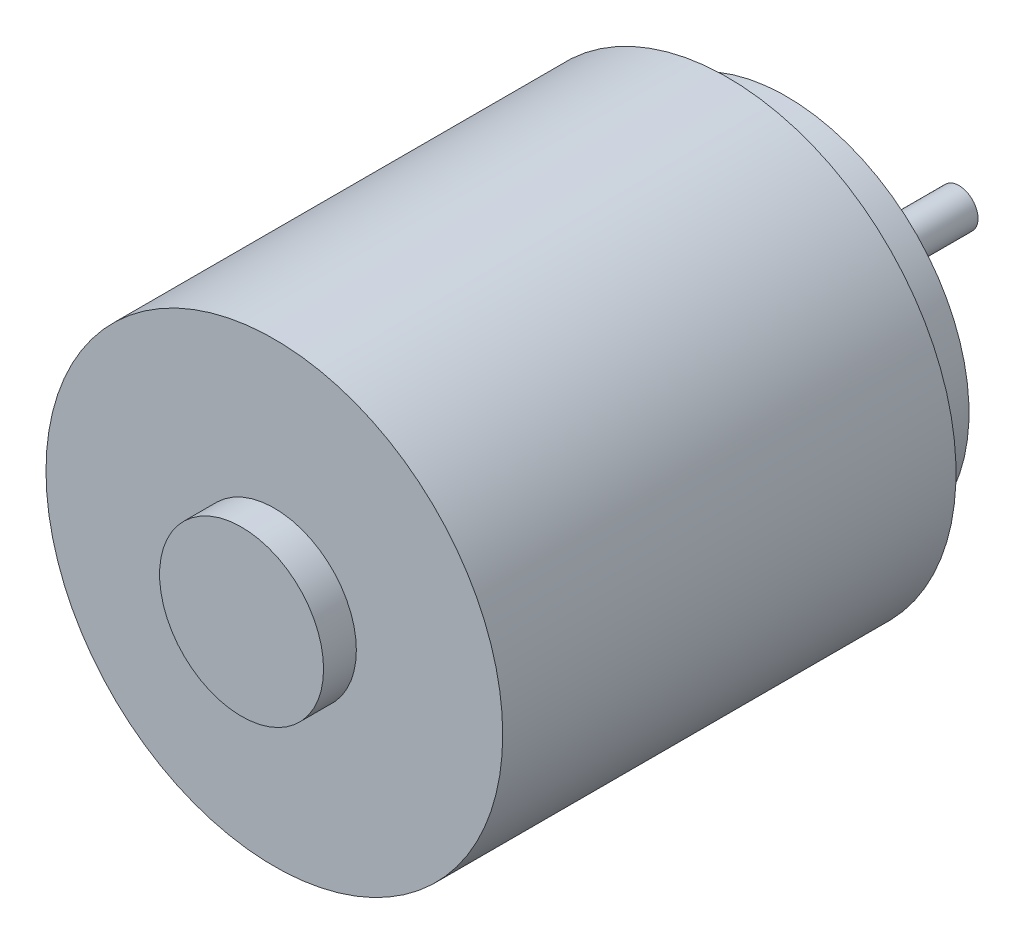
ISO-10303-21;
HEADER;
FILE_DESCRIPTION(('STEP AP214'),'2;1');
FILE_NAME('part.step','',(''),(''),'','','');
FILE_SCHEMA(('AUTOMOTIVE_DESIGN { 1 0 10303 214 1 1 1 1 }'));
ENDSEC;
DATA;
#1=APPLICATION_CONTEXT('core data for automotive mechanical design processes');
#2=APPLICATION_PROTOCOL_DEFINITION('international standard','automotive_design',2000,#1);
#3=PRODUCT_CONTEXT('',#1,'mechanical');
#4=PRODUCT('Part','Part','',(#3));
#5=PRODUCT_RELATED_PRODUCT_CATEGORY('part','',(#4));
#6=PRODUCT_DEFINITION_FORMATION('','',#4);
#7=PRODUCT_DEFINITION_CONTEXT('part definition',#1,'design');
#8=PRODUCT_DEFINITION('design','',#6,#7);
#9=PRODUCT_DEFINITION_SHAPE('','',#8);
#10=(LENGTH_UNIT() NAMED_UNIT(*) SI_UNIT(.MILLI.,.METRE.));
#11=(NAMED_UNIT(*) PLANE_ANGLE_UNIT() SI_UNIT($,.RADIAN.));
#12=(NAMED_UNIT(*) SI_UNIT($,.STERADIAN.) SOLID_ANGLE_UNIT());
#13=UNCERTAINTY_MEASURE_WITH_UNIT(LENGTH_MEASURE(1.E-05),#10,'distance_accuracy_value','');
#14=(GEOMETRIC_REPRESENTATION_CONTEXT(3) GLOBAL_UNCERTAINTY_ASSIGNED_CONTEXT((#13)) GLOBAL_UNIT_ASSIGNED_CONTEXT((#10,
#11,#12)) REPRESENTATION_CONTEXT('',''));
#15=CARTESIAN_POINT('',(0.,0.,0.));
#16=DIRECTION('',(0.,0.,1.));
#17=DIRECTION('',(1.,0.,0.));
#18=AXIS2_PLACEMENT_3D('',#15,#16,#17);
#19=CARTESIAN_POINT('',(0.,0.,-1.7));
#20=DIRECTION('',(0.,0.,-1.));
#21=DIRECTION('',(-1.,0.,0.));
#22=AXIS2_PLACEMENT_3D('',#19,#20,#21);
#23=PLANE('',#22);
#24=CARTESIAN_POINT('',(0.,0.,-1.7));
#25=DIRECTION('',(0.,0.,-1.));
#26=DIRECTION('',(-1.,0.,0.));
#27=AXIS2_PLACEMENT_3D('',#24,#25,#26);
#28=CIRCLE('',#27,3.0099);
#29=CARTESIAN_POINT('',(-3.0099,0.,-1.7));
#30=VERTEX_POINT('',#29);
#31=EDGE_CURVE('E58',#30,#30,#28,.T.);
#32=ORIENTED_EDGE('',*,*,#31,.T.);
#33=EDGE_LOOP('',(#32));
#34=FACE_BOUND('',#33,.T.);
#35=CARTESIAN_POINT('',(0.,0.,-1.7));
#36=DIRECTION('',(0.,0.,-1.));
#37=DIRECTION('',(-1.,0.,0.));
#38=AXIS2_PLACEMENT_3D('',#35,#36,#37);
#39=CIRCLE('',#38,0.9906);
#40=CARTESIAN_POINT('',(-0.9906,0.,-1.7));
#41=VERTEX_POINT('',#40);
#42=EDGE_CURVE('E66',#41,#41,#39,.T.);
#43=ORIENTED_EDGE('',*,*,#42,.F.);
#44=EDGE_LOOP('',(#43));
#45=FACE_BOUND('',#44,.T.);
#46=ADVANCED_FACE('F27',(#34,#45),#23,.T.);
#47=CARTESIAN_POINT('',(0.,0.,0.));
#48=DIRECTION('',(0.,0.,1.));
#49=DIRECTION('',(1.,0.,0.));
#50=AXIS2_PLACEMENT_3D('',#47,#48,#49);
#51=PLANE('',#50);
#52=CARTESIAN_POINT('',(0.,0.,0.));
#53=DIRECTION('',(0.,0.,-1.));
#54=DIRECTION('',(-1.,0.,0.));
#55=AXIS2_PLACEMENT_3D('',#52,#53,#54);
#56=CIRCLE('',#55,9.4615);
#57=CARTESIAN_POINT('',(-9.4615,0.,0.));
#58=VERTEX_POINT('',#57);
#59=EDGE_CURVE('E53',#58,#58,#56,.T.);
#60=ORIENTED_EDGE('',*,*,#59,.T.);
#61=EDGE_LOOP('',(#60));
#62=FACE_BOUND('',#61,.T.);
#63=CARTESIAN_POINT('',(0.,0.,0.));
#64=DIRECTION('',(0.,0.,1.));
#65=DIRECTION('',(1.,0.,0.));
#66=AXIS2_PLACEMENT_3D('',#63,#64,#65);
#67=CIRCLE('',#66,3.0099);
#68=CARTESIAN_POINT('',(3.0099,0.,0.));
#69=VERTEX_POINT('',#68);
#70=EDGE_CURVE('E10',#69,#69,#67,.F.);
#71=ORIENTED_EDGE('',*,*,#70,.F.);
#72=EDGE_LOOP('',(#71));
#73=FACE_BOUND('',#72,.T.);
#74=ADVANCED_FACE('F73',(#62,#73),#51,.F.);
#75=CARTESIAN_POINT('',(0.,0.,26.543));
#76=DIRECTION('',(0.,0.,-1.));
#77=DIRECTION('',(-1.,0.,0.));
#78=AXIS2_PLACEMENT_3D('',#75,#76,#77);
#79=CYLINDRICAL_SURFACE('',#78,11.8364);
#80=CARTESIAN_POINT('',(0.,0.,26.543));
#81=DIRECTION('',(0.,0.,1.));
#82=DIRECTION('',(1.,0.,0.));
#83=AXIS2_PLACEMENT_3D('',#80,#81,#82);
#84=CIRCLE('',#83,11.8364);
#85=CARTESIAN_POINT('',(11.8364,0.,26.543));
#86=VERTEX_POINT('',#85);
#87=EDGE_CURVE('E34',#86,#86,#84,.T.);
#88=ORIENTED_EDGE('',*,*,#87,.F.);
#89=EDGE_LOOP('',(#88));
#90=FACE_BOUND('',#89,.T.);
#91=CARTESIAN_POINT('',(0.,0.,3.048));
#92=DIRECTION('',(0.,0.,-1.));
#93=DIRECTION('',(-1.,0.,0.));
#94=AXIS2_PLACEMENT_3D('',#91,#92,#93);
#95=CIRCLE('',#94,11.8364);
#96=CARTESIAN_POINT('',(-11.8364,0.,3.048));
#97=VERTEX_POINT('',#96);
#98=EDGE_CURVE('E46',#97,#97,#95,.T.);
#99=ORIENTED_EDGE('',*,*,#98,.F.);
#100=EDGE_LOOP('',(#99));
#101=FACE_BOUND('',#100,.T.);
#102=ADVANCED_FACE('F29',(#90,#101),#79,.T.);
#103=CARTESIAN_POINT('',(0.,0.,26.543));
#104=DIRECTION('',(0.,0.,1.));
#105=DIRECTION('',(1.,0.,0.));
#106=AXIS2_PLACEMENT_3D('',#103,#104,#105);
#107=PLANE('',#106);
#108=ORIENTED_EDGE('',*,*,#87,.T.);
#109=EDGE_LOOP('',(#108));
#110=FACE_BOUND('',#109,.T.);
#111=CARTESIAN_POINT('',(0.,0.,26.543));
#112=DIRECTION('',(0.,0.,1.));
#113=DIRECTION('',(1.,0.,0.));
#114=AXIS2_PLACEMENT_3D('',#111,#112,#113);
#115=CIRCLE('',#114,4.25);
#116=CARTESIAN_POINT('',(4.25,0.,26.543));
#117=VERTEX_POINT('',#116);
#118=EDGE_CURVE('E43',#117,#117,#115,.T.);
#119=ORIENTED_EDGE('',*,*,#118,.F.);
#120=EDGE_LOOP('',(#119));
#121=FACE_BOUND('',#120,.T.);
#122=ADVANCED_FACE('F101',(#110,#121),#107,.T.);
#123=CARTESIAN_POINT('',(0.,0.,28.243));
#124=DIRECTION('',(0.,0.,-1.));
#125=DIRECTION('',(-1.,0.,0.));
#126=AXIS2_PLACEMENT_3D('',#123,#124,#125);
#127=CYLINDRICAL_SURFACE('',#126,4.25);
#128=CARTESIAN_POINT('',(0.,0.,28.243));
#129=DIRECTION('',(0.,0.,1.));
#130=DIRECTION('',(1.,0.,0.));
#131=AXIS2_PLACEMENT_3D('',#128,#129,#130);
#132=CIRCLE('',#131,4.25);
#133=CARTESIAN_POINT('',(4.25,0.,28.243));
#134=VERTEX_POINT('',#133);
#135=EDGE_CURVE('E38',#134,#134,#132,.T.);
#136=ORIENTED_EDGE('',*,*,#135,.F.);
#137=EDGE_LOOP('',(#136));
#138=FACE_BOUND('',#137,.T.);
#139=ORIENTED_EDGE('',*,*,#118,.T.);
#140=EDGE_LOOP('',(#139));
#141=FACE_BOUND('',#140,.T.);
#142=ADVANCED_FACE('F98',(#138,#141),#127,.T.);
#143=CARTESIAN_POINT('',(0.,0.,28.243));
#144=DIRECTION('',(0.,0.,1.));
#145=DIRECTION('',(1.,0.,0.));
#146=AXIS2_PLACEMENT_3D('',#143,#144,#145);
#147=PLANE('',#146);
#148=ORIENTED_EDGE('',*,*,#135,.T.);
#149=EDGE_LOOP('',(#148));
#150=FACE_BOUND('',#149,.T.);
#151=ADVANCED_FACE('F94',(#150),#147,.T.);
#152=CARTESIAN_POINT('',(0.,0.,3.048));
#153=DIRECTION('',(0.,0.,-1.));
#154=DIRECTION('',(-1.,0.,0.));
#155=AXIS2_PLACEMENT_3D('',#152,#153,#154);
#156=PLANE('',#155);
#157=CARTESIAN_POINT('',(0.,0.,3.048));
#158=DIRECTION('',(0.,0.,-1.));
#159=DIRECTION('',(-1.,0.,0.));
#160=AXIS2_PLACEMENT_3D('',#157,#158,#159);
#161=CIRCLE('',#160,9.4615);
#162=CARTESIAN_POINT('',(-9.4615,0.,3.048));
#163=VERTEX_POINT('',#162);
#164=EDGE_CURVE('E48',#163,#163,#161,.T.);
#165=ORIENTED_EDGE('',*,*,#164,.F.);
#166=EDGE_LOOP('',(#165));
#167=FACE_BOUND('',#166,.T.);
#168=ORIENTED_EDGE('',*,*,#98,.T.);
#169=EDGE_LOOP('',(#168));
#170=FACE_BOUND('',#169,.T.);
#171=ADVANCED_FACE('F91',(#167,#170),#156,.T.);
#172=CARTESIAN_POINT('',(0.,0.,3.048));
#173=DIRECTION('',(0.,0.,-1.));
#174=DIRECTION('',(-1.,0.,0.));
#175=AXIS2_PLACEMENT_3D('',#172,#173,#174);
#176=CYLINDRICAL_SURFACE('',#175,9.4615);
#177=CARTESIAN_POINT('',(-9.4615,0.,3.048));
#178=CARTESIAN_POINT('',(-9.4615,0.,3.01625));
#179=CARTESIAN_POINT('',(-9.4615,0.,2.9845));
#180=CARTESIAN_POINT('',(-9.4615,0.,2.921));
#181=CARTESIAN_POINT('',(-9.4615,0.,2.88925));
#182=CARTESIAN_POINT('',(-9.4615,0.,2.82575));
#183=CARTESIAN_POINT('',(-9.4615,0.,2.794));
#184=CARTESIAN_POINT('',(-9.4615,0.,2.7305));
#185=CARTESIAN_POINT('',(-9.4615,0.,2.69875));
#186=CARTESIAN_POINT('',(-9.4615,0.,2.63525));
#187=CARTESIAN_POINT('',(-9.4615,0.,2.6035));
#188=CARTESIAN_POINT('',(-9.4615,0.,2.54));
#189=CARTESIAN_POINT('',(-9.4615,0.,2.50825));
#190=CARTESIAN_POINT('',(-9.4615,0.,2.44475));
#191=CARTESIAN_POINT('',(-9.4615,0.,2.413));
#192=CARTESIAN_POINT('',(-9.4615,0.,2.3495));
#193=CARTESIAN_POINT('',(-9.4615,0.,2.31775));
#194=CARTESIAN_POINT('',(-9.4615,0.,2.25425));
#195=CARTESIAN_POINT('',(-9.4615,0.,2.2225));
#196=CARTESIAN_POINT('',(-9.4615,0.,2.159));
#197=CARTESIAN_POINT('',(-9.4615,0.,2.12725));
#198=CARTESIAN_POINT('',(-9.4615,0.,2.06375));
#199=CARTESIAN_POINT('',(-9.4615,0.,2.032));
#200=CARTESIAN_POINT('',(-9.4615,0.,1.9685));
#201=CARTESIAN_POINT('',(-9.4615,0.,1.93675));
#202=CARTESIAN_POINT('',(-9.4615,0.,1.87325));
#203=CARTESIAN_POINT('',(-9.4615,0.,1.8415));
#204=CARTESIAN_POINT('',(-9.4615,0.,1.778));
#205=CARTESIAN_POINT('',(-9.4615,0.,1.74625));
#206=CARTESIAN_POINT('',(-9.4615,0.,1.68275));
#207=CARTESIAN_POINT('',(-9.4615,0.,1.651));
#208=CARTESIAN_POINT('',(-9.4615,0.,1.5875));
#209=CARTESIAN_POINT('',(-9.4615,0.,1.55575));
#210=CARTESIAN_POINT('',(-9.4615,0.,1.49225));
#211=CARTESIAN_POINT('',(-9.4615,0.,1.4605));
#212=CARTESIAN_POINT('',(-9.4615,0.,1.397));
#213=CARTESIAN_POINT('',(-9.4615,0.,1.36525));
#214=CARTESIAN_POINT('',(-9.4615,0.,1.30175));
#215=CARTESIAN_POINT('',(-9.4615,0.,1.27));
#216=CARTESIAN_POINT('',(-9.4615,0.,1.2065));
#217=CARTESIAN_POINT('',(-9.4615,0.,1.17475));
#218=CARTESIAN_POINT('',(-9.4615,0.,1.11125));
#219=CARTESIAN_POINT('',(-9.4615,0.,1.0795));
#220=CARTESIAN_POINT('',(-9.4615,0.,1.016));
#221=CARTESIAN_POINT('',(-9.4615,0.,0.98425));
#222=CARTESIAN_POINT('',(-9.4615,0.,0.92075));
#223=CARTESIAN_POINT('',(-9.4615,0.,0.889));
#224=CARTESIAN_POINT('',(-9.4615,0.,0.8255));
#225=CARTESIAN_POINT('',(-9.4615,0.,0.79375));
#226=CARTESIAN_POINT('',(-9.4615,0.,0.73025));
#227=CARTESIAN_POINT('',(-9.4615,0.,0.6985));
#228=CARTESIAN_POINT('',(-9.4615,0.,0.635));
#229=CARTESIAN_POINT('',(-9.4615,0.,0.60325));
#230=CARTESIAN_POINT('',(-9.4615,0.,0.53975));
#231=CARTESIAN_POINT('',(-9.4615,0.,0.508));
#232=CARTESIAN_POINT('',(-9.4615,0.,0.4445));
#233=CARTESIAN_POINT('',(-9.4615,0.,0.41275));
#234=CARTESIAN_POINT('',(-9.4615,0.,0.34925));
#235=CARTESIAN_POINT('',(-9.4615,0.,0.3175));
#236=CARTESIAN_POINT('',(-9.4615,0.,0.254));
#237=CARTESIAN_POINT('',(-9.4615,0.,0.22225));
#238=CARTESIAN_POINT('',(-9.4615,0.,0.15875));
#239=CARTESIAN_POINT('',(-9.4615,0.,0.127));
#240=CARTESIAN_POINT('',(-9.4615,0.,0.0634999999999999));
#241=CARTESIAN_POINT('',(-9.4615,0.,0.03175));
#242=CARTESIAN_POINT('',(-9.4615,0.,0.));
#243=B_SPLINE_CURVE_WITH_KNOTS('',3,(#177,#178,#179,#180,#181,#182,#183,#184,#185,#186,#187,
#188,#189,#190,#191,#192,#193,#194,#195,#196,#197,#198,#199,#200,#201,#202,#203,#204,#205,#206,
#207,#208,#209,#210,#211,#212,#213,#214,#215,#216,#217,#218,#219,#220,#221,#222,#223,#224,#225,
#226,#227,#228,#229,#230,#231,#232,#233,#234,#235,#236,#237,#238,#239,#240,#241,#242),
.UNSPECIFIED.,.F.,.F.,(4,2,2,2,2,2,2,2,2,2,2,2,2,2,2,2,2,2,2,2,2,2,2,2,2,2,2,2,2,2,2,2,4),(0.,
0.0952499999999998,0.1905,0.28575,0.381,0.47625,0.5715,0.66675,0.762,0.85725,0.9525,1.04775,
1.143,1.23825,1.3335,1.42875,1.524,1.61925,1.7145,1.80975,1.905,2.00025,2.0955,2.19075,2.286,
2.38125,2.4765,2.57175,2.667,2.76225,2.8575,2.95275,3.048),.UNSPECIFIED.);
#244=EDGE_CURVE('BSEAM87',#163,#58,#243,.T.);
#245=ORIENTED_EDGE('',*,*,#164,.T.);
#246=ORIENTED_EDGE('',*,*,#59,.F.);
#247=ORIENTED_EDGE('',*,*,#244,.T.);
#248=ORIENTED_EDGE('',*,*,#244,.F.);
#249=EDGE_LOOP('',(#245,#247,#246,#248));
#250=FACE_BOUND('',#249,.T.);
#251=ADVANCED_FACE('F87',(#250),#176,.T.);
#252=CARTESIAN_POINT('',(0.,0.,-1.7));
#253=DIRECTION('',(0.,0.,1.));
#254=DIRECTION('',(1.,0.,0.));
#255=AXIS2_PLACEMENT_3D('',#252,#253,#254);
#256=CYLINDRICAL_SURFACE('',#255,3.0099);
#257=ORIENTED_EDGE('',*,*,#31,.F.);
#258=EDGE_LOOP('',(#257));
#259=FACE_BOUND('',#258,.T.);
#260=ORIENTED_EDGE('',*,*,#70,.T.);
#261=EDGE_LOOP('',(#260));
#262=FACE_BOUND('',#261,.T.);
#263=ADVANCED_FACE('F84',(#259,#262),#256,.T.);
#264=CARTESIAN_POINT('',(0.,0.,-8.939));
#265=DIRECTION('',(0.,0.,1.));
#266=DIRECTION('',(1.,0.,0.));
#267=AXIS2_PLACEMENT_3D('',#264,#265,#266);
#268=CYLINDRICAL_SURFACE('',#267,0.9906);
#269=CARTESIAN_POINT('',(0.,0.,-8.939));
#270=DIRECTION('',(0.,0.,-1.));
#271=DIRECTION('',(-1.,0.,0.));
#272=AXIS2_PLACEMENT_3D('',#269,#270,#271);
#273=CIRCLE('',#272,0.9906);
#274=CARTESIAN_POINT('',(-0.9906,0.,-8.939));
#275=VERTEX_POINT('',#274);
#276=EDGE_CURVE('E63',#275,#275,#273,.T.);
#277=ORIENTED_EDGE('',*,*,#276,.F.);
#278=EDGE_LOOP('',(#277));
#279=FACE_BOUND('',#278,.T.);
#280=ORIENTED_EDGE('',*,*,#42,.T.);
#281=EDGE_LOOP('',(#280));
#282=FACE_BOUND('',#281,.T.);
#283=ADVANCED_FACE('F70',(#279,#282),#268,.T.);
#284=CARTESIAN_POINT('',(0.,0.,-8.939));
#285=DIRECTION('',(0.,0.,-1.));
#286=DIRECTION('',(-1.,0.,0.));
#287=AXIS2_PLACEMENT_3D('',#284,#285,#286);
#288=PLANE('',#287);
#289=ORIENTED_EDGE('',*,*,#276,.T.);
#290=EDGE_LOOP('',(#289));
#291=FACE_BOUND('',#290,.T.);
#292=ADVANCED_FACE('F137',(#291),#288,.T.);
#293=CLOSED_SHELL('',(#46,#74,#102,#122,#142,#151,#171,#251,#263,#283,#292));
#294=MANIFOLD_SOLID_BREP('B2',#293);
#295=ADVANCED_BREP_SHAPE_REPRESENTATION('',(#18,#294),#14);
#296=SHAPE_DEFINITION_REPRESENTATION(#9,#295);
ENDSEC;
END-ISO-10303-21;
